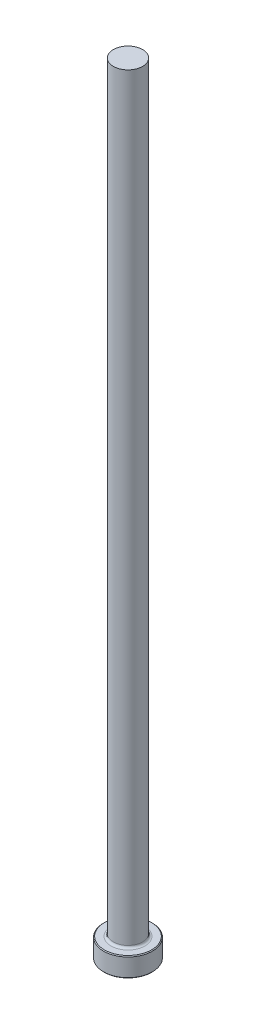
ISO-10303-21;
HEADER;
FILE_DESCRIPTION(('STEP AP214'),'2;1');
FILE_NAME('part.step','',(''),(''),'','','');
FILE_SCHEMA(('AUTOMOTIVE_DESIGN { 1 0 10303 214 1 1 1 1 }'));
ENDSEC;
DATA;
#1=APPLICATION_CONTEXT('core data for automotive mechanical design processes');
#2=APPLICATION_PROTOCOL_DEFINITION('international standard','automotive_design',2000,#1);
#3=PRODUCT_CONTEXT('',#1,'mechanical');
#4=PRODUCT('Part','Part','',(#3));
#5=PRODUCT_RELATED_PRODUCT_CATEGORY('part','',(#4));
#6=PRODUCT_DEFINITION_FORMATION('','',#4);
#7=PRODUCT_DEFINITION_CONTEXT('part definition',#1,'design');
#8=PRODUCT_DEFINITION('design','',#6,#7);
#9=PRODUCT_DEFINITION_SHAPE('','',#8);
#10=(LENGTH_UNIT() NAMED_UNIT(*) SI_UNIT(.MILLI.,.METRE.));
#11=(NAMED_UNIT(*) PLANE_ANGLE_UNIT() SI_UNIT($,.RADIAN.));
#12=(NAMED_UNIT(*) SI_UNIT($,.STERADIAN.) SOLID_ANGLE_UNIT());
#13=UNCERTAINTY_MEASURE_WITH_UNIT(LENGTH_MEASURE(1.E-05),#10,'distance_accuracy_value','');
#14=(GEOMETRIC_REPRESENTATION_CONTEXT(3) GLOBAL_UNCERTAINTY_ASSIGNED_CONTEXT((#13)) GLOBAL_UNIT_ASSIGNED_CONTEXT((#10,
#11,#12)) REPRESENTATION_CONTEXT('',''));
#15=CARTESIAN_POINT('',(0.,0.,0.));
#16=DIRECTION('',(0.,0.,1.));
#17=DIRECTION('',(1.,0.,0.));
#18=AXIS2_PLACEMENT_3D('',#15,#16,#17);
#19=CARTESIAN_POINT('',(0.,0.,0.));
#20=DIRECTION('',(0.,-1.,0.));
#21=DIRECTION('',(0.,0.,-1.));
#22=AXIS2_PLACEMENT_3D('',#19,#20,#21);
#23=PLANE('',#22);
#24=CARTESIAN_POINT('',(0.,0.,0.));
#25=DIRECTION('',(0.,-1.,0.));
#26=DIRECTION('',(0.,0.,-1.));
#27=AXIS2_PLACEMENT_3D('',#24,#25,#26);
#28=CIRCLE('',#27,7.68349999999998);
#29=CARTESIAN_POINT('',(0.,0.,-7.68349999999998));
#30=VERTEX_POINT('',#29);
#31=EDGE_CURVE('E46',#30,#30,#28,.T.);
#32=ORIENTED_EDGE('',*,*,#31,.T.);
#33=EDGE_LOOP('',(#32));
#34=FACE_BOUND('',#33,.T.);
#35=ADVANCED_FACE('F35',(#34),#23,.T.);
#36=CARTESIAN_POINT('',(0.,259.958771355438,0.));
#37=DIRECTION('',(0.,1.,0.));
#38=DIRECTION('',(0.,0.,1.));
#39=AXIS2_PLACEMENT_3D('',#36,#37,#38);
#40=CYLINDRICAL_SURFACE('',#39,7.93749999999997);
#41=CARTESIAN_POINT('',(0.,6.09599999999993,0.));
#42=DIRECTION('',(0.,1.,0.));
#43=DIRECTION('',(0.,0.,1.));
#44=AXIS2_PLACEMENT_3D('',#41,#42,#43);
#45=CIRCLE('',#44,7.93749999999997);
#46=CARTESIAN_POINT('',(0.,6.09599999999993,7.93749999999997));
#47=VERTEX_POINT('',#46);
#48=EDGE_CURVE('E50',#47,#47,#45,.F.);
#49=ORIENTED_EDGE('',*,*,#48,.T.);
#50=EDGE_LOOP('',(#49));
#51=FACE_BOUND('',#50,.T.);
#52=CARTESIAN_POINT('',(0.,0.253999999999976,0.));
#53=DIRECTION('',(0.,-1.,0.));
#54=DIRECTION('',(0.,0.,-1.));
#55=AXIS2_PLACEMENT_3D('',#52,#53,#54);
#56=CIRCLE('',#55,7.93749999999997);
#57=CARTESIAN_POINT('',(0.,0.253999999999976,-7.93749999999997));
#58=VERTEX_POINT('',#57);
#59=EDGE_CURVE('E55',#58,#58,#56,.F.);
#60=ORIENTED_EDGE('',*,*,#59,.T.);
#61=EDGE_LOOP('',(#60));
#62=FACE_BOUND('',#61,.T.);
#63=ADVANCED_FACE('F77',(#51,#62),#40,.T.);
#64=CARTESIAN_POINT('',(-7.93749999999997,6.35,0.));
#65=DIRECTION('',(0.,1.,0.));
#66=DIRECTION('',(0.,0.,1.));
#67=AXIS2_PLACEMENT_3D('',#64,#65,#66);
#68=PLANE('',#67);
#69=CARTESIAN_POINT('',(0.,6.35,0.));
#70=DIRECTION('',(0.,1.,0.));
#71=DIRECTION('',(0.,0.,1.));
#72=AXIS2_PLACEMENT_3D('',#69,#70,#71);
#73=CIRCLE('',#72,5.52449999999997);
#74=CARTESIAN_POINT('',(0.,6.35,5.52449999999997));
#75=VERTEX_POINT('',#74);
#76=EDGE_CURVE('E10',#75,#75,#73,.F.);
#77=ORIENTED_EDGE('',*,*,#76,.T.);
#78=EDGE_LOOP('',(#77));
#79=FACE_BOUND('',#78,.T.);
#80=CARTESIAN_POINT('',(0.,6.35,0.));
#81=DIRECTION('',(0.,1.,0.));
#82=DIRECTION('',(0.,0.,1.));
#83=AXIS2_PLACEMENT_3D('',#80,#81,#82);
#84=CIRCLE('',#83,7.68349999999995);
#85=CARTESIAN_POINT('',(0.,6.35,7.68349999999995));
#86=VERTEX_POINT('',#85);
#87=EDGE_CURVE('E58',#86,#86,#84,.T.);
#88=ORIENTED_EDGE('',*,*,#87,.T.);
#89=EDGE_LOOP('',(#88));
#90=FACE_BOUND('',#89,.T.);
#91=ADVANCED_FACE('F69',(#79,#90),#68,.T.);
#92=CARTESIAN_POINT('',(0.,259.958771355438,0.));
#93=DIRECTION('',(0.,1.,0.));
#94=DIRECTION('',(0.,0.,1.));
#95=AXIS2_PLACEMENT_3D('',#92,#93,#94);
#96=CYLINDRICAL_SURFACE('',#95,4.76249999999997);
#97=CARTESIAN_POINT('',(0.,7.11200000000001,0.));
#98=DIRECTION('',(0.,1.,0.));
#99=DIRECTION('',(0.,0.,1.));
#100=AXIS2_PLACEMENT_3D('',#97,#98,#99);
#101=CIRCLE('',#100,4.76249999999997);
#102=CARTESIAN_POINT('',(0.,7.11200000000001,4.76249999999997));
#103=VERTEX_POINT('',#102);
#104=EDGE_CURVE('E42',#103,#103,#101,.T.);
#105=ORIENTED_EDGE('',*,*,#104,.T.);
#106=EDGE_LOOP('',(#105));
#107=FACE_BOUND('',#106,.T.);
#108=CARTESIAN_POINT('',(0.,254.,0.));
#109=DIRECTION('',(0.,1.,0.));
#110=DIRECTION('',(0.,0.,1.));
#111=AXIS2_PLACEMENT_3D('',#108,#109,#110);
#112=CIRCLE('',#111,4.76249999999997);
#113=CARTESIAN_POINT('',(0.,254.,4.76249999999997));
#114=VERTEX_POINT('',#113);
#115=EDGE_CURVE('E61',#114,#114,#112,.T.);
#116=ORIENTED_EDGE('',*,*,#115,.F.);
#117=EDGE_LOOP('',(#116));
#118=FACE_BOUND('',#117,.T.);
#119=ADVANCED_FACE('F67',(#107,#118),#96,.T.);
#120=CARTESIAN_POINT('',(-4.76249999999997,254.,0.));
#121=DIRECTION('',(0.,1.,0.));
#122=DIRECTION('',(0.,0.,1.));
#123=AXIS2_PLACEMENT_3D('',#120,#121,#122);
#124=PLANE('',#123);
#125=ORIENTED_EDGE('',*,*,#115,.T.);
#126=EDGE_LOOP('',(#125));
#127=FACE_BOUND('',#126,.T.);
#128=ADVANCED_FACE('F65',(#127),#124,.T.);
#129=CARTESIAN_POINT('',(0.,6.35000000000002,0.));
#130=DIRECTION('',(0.,-1.,0.));
#131=DIRECTION('',(0.,0.,-1.));
#132=AXIS2_PLACEMENT_3D('',#129,#130,#131);
#133=CONICAL_SURFACE('',#132,7.68349999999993,0.78539816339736);
#134=ORIENTED_EDGE('',*,*,#48,.F.);
#135=EDGE_LOOP('',(#134));
#136=FACE_BOUND('',#135,.T.);
#137=ORIENTED_EDGE('',*,*,#87,.F.);
#138=EDGE_LOOP('',(#137));
#139=FACE_BOUND('',#138,.T.);
#140=ADVANCED_FACE('F75',(#136,#139),#133,.T.);
#141=CARTESIAN_POINT('',(0.,0.253999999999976,0.));
#142=DIRECTION('',(0.,1.,0.));
#143=DIRECTION('',(0.,0.,1.));
#144=AXIS2_PLACEMENT_3D('',#141,#142,#143);
#145=CONICAL_SURFACE('',#144,7.93749999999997,0.785398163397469);
#146=ORIENTED_EDGE('',*,*,#31,.F.);
#147=EDGE_LOOP('',(#146));
#148=FACE_BOUND('',#147,.T.);
#149=ORIENTED_EDGE('',*,*,#59,.F.);
#150=EDGE_LOOP('',(#149));
#151=FACE_BOUND('',#150,.T.);
#152=ADVANCED_FACE('F89',(#148,#151),#145,.T.);
#153=CARTESIAN_POINT('',(0.,7.11200000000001,0.));
#154=DIRECTION('',(0.,1.,0.));
#155=DIRECTION('',(0.,0.,1.));
#156=AXIS2_PLACEMENT_3D('',#153,#154,#155);
#157=TOROIDAL_SURFACE('',#156,5.52449999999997,0.762);
#158=ORIENTED_EDGE('',*,*,#76,.F.);
#159=EDGE_LOOP('',(#158));
#160=FACE_BOUND('',#159,.T.);
#161=ORIENTED_EDGE('',*,*,#104,.F.);
#162=EDGE_LOOP('',(#161));
#163=FACE_BOUND('',#162,.T.);
#164=ADVANCED_FACE('F37',(#160,#163),#157,.F.);
#165=CLOSED_SHELL('',(#35,#63,#91,#119,#128,#140,#152,#164));
#166=MANIFOLD_SOLID_BREP('B2',#165);
#167=ADVANCED_BREP_SHAPE_REPRESENTATION('',(#18,#166),#14);
#168=SHAPE_DEFINITION_REPRESENTATION(#9,#167);
ENDSEC;
END-ISO-10303-21;
